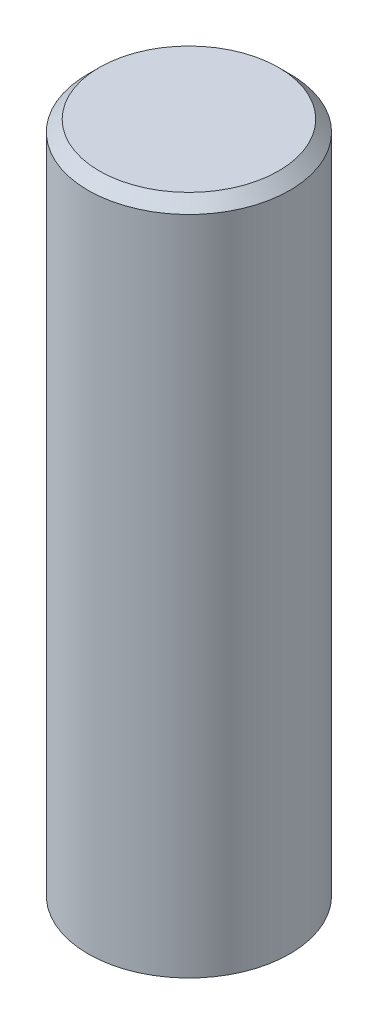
ISO-10303-21;
HEADER;
FILE_DESCRIPTION(('STEP AP214'),'2;1');
FILE_NAME('part.step','',(''),(''),'','','');
FILE_SCHEMA(('AUTOMOTIVE_DESIGN { 1 0 10303 214 1 1 1 1 }'));
ENDSEC;
DATA;
#1=APPLICATION_CONTEXT('core data for automotive mechanical design processes');
#2=APPLICATION_PROTOCOL_DEFINITION('international standard','automotive_design',2000,#1);
#3=PRODUCT_CONTEXT('',#1,'mechanical');
#4=PRODUCT('Part','Part','',(#3));
#5=PRODUCT_RELATED_PRODUCT_CATEGORY('part','',(#4));
#6=PRODUCT_DEFINITION_FORMATION('','',#4);
#7=PRODUCT_DEFINITION_CONTEXT('part definition',#1,'design');
#8=PRODUCT_DEFINITION('design','',#6,#7);
#9=PRODUCT_DEFINITION_SHAPE('','',#8);
#10=(LENGTH_UNIT() NAMED_UNIT(*) SI_UNIT(.MILLI.,.METRE.));
#11=(NAMED_UNIT(*) PLANE_ANGLE_UNIT() SI_UNIT($,.RADIAN.));
#12=(NAMED_UNIT(*) SI_UNIT($,.STERADIAN.) SOLID_ANGLE_UNIT());
#13=UNCERTAINTY_MEASURE_WITH_UNIT(LENGTH_MEASURE(1.E-05),#10,'distance_accuracy_value','');
#14=(GEOMETRIC_REPRESENTATION_CONTEXT(3) GLOBAL_UNCERTAINTY_ASSIGNED_CONTEXT((#13)) GLOBAL_UNIT_ASSIGNED_CONTEXT((#10,
#11,#12)) REPRESENTATION_CONTEXT('',''));
#15=CARTESIAN_POINT('',(0.,0.,0.));
#16=DIRECTION('',(0.,0.,1.));
#17=DIRECTION('',(1.,0.,0.));
#18=AXIS2_PLACEMENT_3D('',#15,#16,#17);
#19=CARTESIAN_POINT('',(0.,60.,0.));
#20=DIRECTION('',(0.,-1.,0.));
#21=DIRECTION('',(0.,0.,-1.));
#22=AXIS2_PLACEMENT_3D('',#19,#20,#21);
#23=CYLINDRICAL_SURFACE('',#22,9.);
#24=CARTESIAN_POINT('',(0.,59.,0.));
#25=DIRECTION('',(0.,1.,0.));
#26=DIRECTION('',(0.,0.,1.));
#27=AXIS2_PLACEMENT_3D('',#24,#25,#26);
#28=CIRCLE('',#27,9.);
#29=CARTESIAN_POINT('',(0.,59.,9.));
#30=VERTEX_POINT('',#29);
#31=EDGE_CURVE('E10',#30,#30,#28,.F.);
#32=ORIENTED_EDGE('',*,*,#31,.T.);
#33=EDGE_LOOP('',(#32));
#34=FACE_BOUND('',#33,.T.);
#35=CARTESIAN_POINT('',(0.,0.,0.));
#36=DIRECTION('',(0.,1.,0.));
#37=DIRECTION('',(0.,0.,1.));
#38=AXIS2_PLACEMENT_3D('',#35,#36,#37);
#39=CIRCLE('',#38,9.);
#40=CARTESIAN_POINT('',(0.,0.,9.));
#41=VERTEX_POINT('',#40);
#42=EDGE_CURVE('E41',#41,#41,#39,.T.);
#43=ORIENTED_EDGE('',*,*,#42,.T.);
#44=EDGE_LOOP('',(#43));
#45=FACE_BOUND('',#44,.T.);
#46=ADVANCED_FACE('F30',(#34,#45),#23,.T.);
#47=CARTESIAN_POINT('',(0.,60.,0.));
#48=DIRECTION('',(0.,1.,0.));
#49=DIRECTION('',(0.,0.,1.));
#50=AXIS2_PLACEMENT_3D('',#47,#48,#49);
#51=PLANE('',#50);
#52=CARTESIAN_POINT('',(0.,60.,0.));
#53=DIRECTION('',(0.,1.,0.));
#54=DIRECTION('',(0.,0.,1.));
#55=AXIS2_PLACEMENT_3D('',#52,#53,#54);
#56=CIRCLE('',#55,8.00000000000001);
#57=CARTESIAN_POINT('',(0.,60.,8.00000000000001));
#58=VERTEX_POINT('',#57);
#59=EDGE_CURVE('E37',#58,#58,#56,.T.);
#60=ORIENTED_EDGE('',*,*,#59,.T.);
#61=EDGE_LOOP('',(#60));
#62=FACE_BOUND('',#61,.T.);
#63=ADVANCED_FACE('F51',(#62),#51,.T.);
#64=CARTESIAN_POINT('',(0.,0.,0.));
#65=DIRECTION('',(0.,1.,0.));
#66=DIRECTION('',(0.,0.,1.));
#67=AXIS2_PLACEMENT_3D('',#64,#65,#66);
#68=PLANE('',#67);
#69=ORIENTED_EDGE('',*,*,#42,.F.);
#70=EDGE_LOOP('',(#69));
#71=FACE_BOUND('',#70,.T.);
#72=ADVANCED_FACE('F49',(#71),#68,.F.);
#73=CARTESIAN_POINT('',(0.,60.,0.));
#74=DIRECTION('',(0.,-1.,0.));
#75=DIRECTION('',(0.,0.,-1.));
#76=AXIS2_PLACEMENT_3D('',#73,#74,#75);
#77=CONICAL_SURFACE('',#76,8.00000000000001,0.785398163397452);
#78=ORIENTED_EDGE('',*,*,#31,.F.);
#79=EDGE_LOOP('',(#78));
#80=FACE_BOUND('',#79,.T.);
#81=ORIENTED_EDGE('',*,*,#59,.F.);
#82=EDGE_LOOP('',(#81));
#83=FACE_BOUND('',#82,.T.);
#84=ADVANCED_FACE('F32',(#80,#83),#77,.T.);
#85=CLOSED_SHELL('',(#46,#63,#72,#84));
#86=MANIFOLD_SOLID_BREP('B2',#85);
#87=ADVANCED_BREP_SHAPE_REPRESENTATION('',(#18,#86),#14);
#88=SHAPE_DEFINITION_REPRESENTATION(#9,#87);
ENDSEC;
END-ISO-10303-21;
